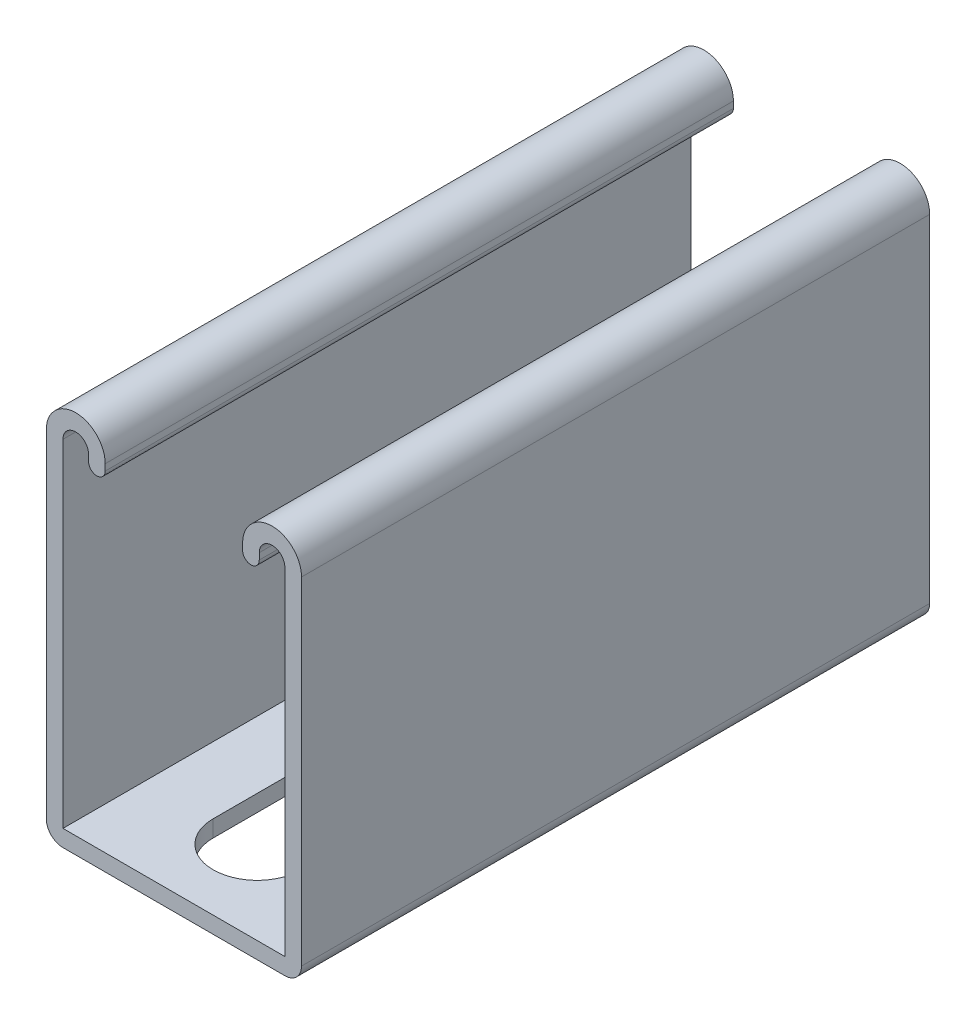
ISO-10303-21;
HEADER;
FILE_DESCRIPTION(('STEP AP214'),'2;1');
FILE_NAME('part.step','',(''),(''),'','','');
FILE_SCHEMA(('AUTOMOTIVE_DESIGN { 1 0 10303 214 1 1 1 1 }'));
ENDSEC;
DATA;
#1=APPLICATION_CONTEXT('core data for automotive mechanical design processes');
#2=APPLICATION_PROTOCOL_DEFINITION('international standard','automotive_design',2000,#1);
#3=PRODUCT_CONTEXT('',#1,'mechanical');
#4=PRODUCT('Part','Part','',(#3));
#5=PRODUCT_RELATED_PRODUCT_CATEGORY('part','',(#4));
#6=PRODUCT_DEFINITION_FORMATION('','',#4);
#7=PRODUCT_DEFINITION_CONTEXT('part definition',#1,'design');
#8=PRODUCT_DEFINITION('design','',#6,#7);
#9=PRODUCT_DEFINITION_SHAPE('','',#8);
#10=(LENGTH_UNIT() NAMED_UNIT(*) SI_UNIT(.MILLI.,.METRE.));
#11=(NAMED_UNIT(*) PLANE_ANGLE_UNIT() SI_UNIT($,.RADIAN.));
#12=(NAMED_UNIT(*) SI_UNIT($,.STERADIAN.) SOLID_ANGLE_UNIT());
#13=UNCERTAINTY_MEASURE_WITH_UNIT(LENGTH_MEASURE(1.E-05),#10,'distance_accuracy_value','');
#14=(GEOMETRIC_REPRESENTATION_CONTEXT(3) GLOBAL_UNCERTAINTY_ASSIGNED_CONTEXT((#13)) GLOBAL_UNIT_ASSIGNED_CONTEXT((#10,
#11,#12)) REPRESENTATION_CONTEXT('',''));
#15=CARTESIAN_POINT('',(0.,0.,0.));
#16=DIRECTION('',(0.,0.,1.));
#17=DIRECTION('',(1.,0.,0.));
#18=AXIS2_PLACEMENT_3D('',#15,#16,#17);
#19=CARTESIAN_POINT('',(-15.875,29.1719,101.6));
#20=DIRECTION('',(0.,0.,-1.));
#21=DIRECTION('',(-1.,0.,0.));
#22=AXIS2_PLACEMENT_3D('',#19,#20,#21);
#23=CYLINDRICAL_SURFACE('',#22,4.7625);
#24=CARTESIAN_POINT('',(-15.875,29.1719,0.));
#25=DIRECTION('',(0.,0.,1.));
#26=DIRECTION('',(-1.,0.,0.));
#27=AXIS2_PLACEMENT_3D('',#24,#25,#26);
#28=CIRCLE('',#27,4.7625);
#29=CARTESIAN_POINT('',(-11.1125,29.1719,0.));
#30=VERTEX_POINT('',#29);
#31=CARTESIAN_POINT('',(-20.6375,29.1719,0.));
#32=VERTEX_POINT('',#31);
#33=EDGE_CURVE('E254',#30,#32,#28,.T.);
#34=ORIENTED_EDGE('',*,*,#33,.T.);
#35=DIRECTION('',(0.,0.,-1.));
#36=VECTOR('',#35,1.);
#37=CARTESIAN_POINT('',(-20.6375,29.1719,101.6));
#38=LINE('',#37,#36);
#39=CARTESIAN_POINT('',(-20.6375,29.1719,101.6));
#40=VERTEX_POINT('',#39);
#41=EDGE_CURVE('E385',#40,#32,#38,.T.);
#42=ORIENTED_EDGE('',*,*,#41,.F.);
#43=CARTESIAN_POINT('',(-15.875,29.1719,101.6));
#44=DIRECTION('',(0.,0.,1.));
#45=DIRECTION('',(-1.,0.,0.));
#46=AXIS2_PLACEMENT_3D('',#43,#44,#45);
#47=CIRCLE('',#46,4.7625);
#48=CARTESIAN_POINT('',(-11.1125,29.1719,101.6));
#49=VERTEX_POINT('',#48);
#50=EDGE_CURVE('E261',#49,#40,#47,.T.);
#51=ORIENTED_EDGE('',*,*,#50,.F.);
#52=DIRECTION('',(0.,0.,-1.));
#53=VECTOR('',#52,1.);
#54=CARTESIAN_POINT('',(-11.1125,29.1719,101.6));
#55=LINE('',#54,#53);
#56=EDGE_CURVE('E299',#49,#30,#55,.T.);
#57=ORIENTED_EDGE('',*,*,#56,.T.);
#58=EDGE_LOOP('',(#34,#42,#51,#57));
#59=FACE_BOUND('',#58,.T.);
#60=ADVANCED_FACE('F33',(#59),#23,.T.);
#61=CARTESIAN_POINT('',(-20.6375,29.1719,101.6));
#62=DIRECTION('',(1.,0.,0.));
#63=DIRECTION('',(0.,1.,0.));
#64=AXIS2_PLACEMENT_3D('',#61,#62,#63);
#65=PLANE('',#64);
#66=DIRECTION('',(0.,-1.,0.));
#67=VECTOR('',#66,1.);
#68=CARTESIAN_POINT('',(-20.6375,29.1719,0.));
#69=LINE('',#68,#67);
#70=CARTESIAN_POINT('',(-20.6375,-25.3238,0.));
#71=VERTEX_POINT('',#70);
#72=EDGE_CURVE('E302',#32,#71,#69,.T.);
#73=ORIENTED_EDGE('',*,*,#72,.T.);
#74=DIRECTION('',(0.,0.,-1.));
#75=VECTOR('',#74,1.);
#76=CARTESIAN_POINT('',(-20.6375,-25.3238,101.6));
#77=LINE('',#76,#75);
#78=CARTESIAN_POINT('',(-20.6375,-25.3238,101.6));
#79=VERTEX_POINT('',#78);
#80=EDGE_CURVE('E382',#79,#71,#77,.T.);
#81=ORIENTED_EDGE('',*,*,#80,.F.);
#82=DIRECTION('',(0.,-1.,0.));
#83=VECTOR('',#82,1.);
#84=CARTESIAN_POINT('',(-20.6375,29.1719,101.6));
#85=LINE('',#84,#83);
#86=EDGE_CURVE('E264',#40,#79,#85,.T.);
#87=ORIENTED_EDGE('',*,*,#86,.F.);
#88=ORIENTED_EDGE('',*,*,#41,.T.);
#89=EDGE_LOOP('',(#73,#81,#87,#88));
#90=FACE_BOUND('',#89,.T.);
#91=ADVANCED_FACE('F426',(#90),#65,.F.);
#92=CARTESIAN_POINT('',(-17.9451,-25.3238,101.6));
#93=DIRECTION('',(0.,0.,-1.));
#94=DIRECTION('',(-1.,0.,0.));
#95=AXIS2_PLACEMENT_3D('',#92,#93,#94);
#96=CYLINDRICAL_SURFACE('',#95,2.6924);
#97=CARTESIAN_POINT('',(-17.9451,-25.3238,0.));
#98=DIRECTION('',(0.,0.,1.));
#99=DIRECTION('',(-1.,0.,0.));
#100=AXIS2_PLACEMENT_3D('',#97,#98,#99);
#101=CIRCLE('',#100,2.6924);
#102=CARTESIAN_POINT('',(-17.9451,-28.0162,0.));
#103=VERTEX_POINT('',#102);
#104=EDGE_CURVE('E304',#71,#103,#101,.T.);
#105=ORIENTED_EDGE('',*,*,#104,.T.);
#106=DIRECTION('',(0.,0.,-1.));
#107=VECTOR('',#106,1.);
#108=CARTESIAN_POINT('',(-17.9451,-28.0162,101.6));
#109=LINE('',#108,#107);
#110=CARTESIAN_POINT('',(-17.9451,-28.0162,101.6));
#111=VERTEX_POINT('',#110);
#112=EDGE_CURVE('E379',#111,#103,#109,.T.);
#113=ORIENTED_EDGE('',*,*,#112,.F.);
#114=CARTESIAN_POINT('',(-17.9451,-25.3238,101.6));
#115=DIRECTION('',(0.,0.,1.));
#116=DIRECTION('',(-1.,0.,0.));
#117=AXIS2_PLACEMENT_3D('',#114,#115,#116);
#118=CIRCLE('',#117,2.6924);
#119=EDGE_CURVE('E267',#79,#111,#118,.T.);
#120=ORIENTED_EDGE('',*,*,#119,.F.);
#121=ORIENTED_EDGE('',*,*,#80,.T.);
#122=EDGE_LOOP('',(#105,#113,#120,#121));
#123=FACE_BOUND('',#122,.T.);
#124=ADVANCED_FACE('F431',(#123),#96,.T.);
#125=CARTESIAN_POINT('',(-17.9451,-28.0162,101.6));
#126=DIRECTION('',(0.,1.,0.));
#127=DIRECTION('',(-1.,0.,0.));
#128=AXIS2_PLACEMENT_3D('',#125,#126,#127);
#129=PLANE('',#128);
#130=DIRECTION('',(0.,0.,-1.));
#131=VECTOR('',#130,1.);
#132=CARTESIAN_POINT('',(-7.14375,-28.0162000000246,73.81875));
#133=LINE('',#132,#131);
#134=CARTESIAN_POINT('',(-7.14375,-28.0162,88.10625));
#135=VERTEX_POINT('',#134);
#136=CARTESIAN_POINT('',(-7.14375,-28.0162000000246,73.81875));
#137=VERTEX_POINT('',#136);
#138=EDGE_CURVE('E207',#135,#137,#133,.T.);
#139=ORIENTED_EDGE('',*,*,#138,.F.);
#140=CARTESIAN_POINT('',(0.,-28.0162000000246,88.10625));
#141=DIRECTION('',(0.,-1.,0.));
#142=DIRECTION('',(1.,0.,0.));
#143=AXIS2_PLACEMENT_3D('',#140,#141,#142);
#144=CIRCLE('',#143,7.14375);
#145=CARTESIAN_POINT('',(7.14375,-28.0162000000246,88.10625));
#146=VERTEX_POINT('',#145);
#147=EDGE_CURVE('E47',#146,#135,#144,.T.);
#148=ORIENTED_EDGE('',*,*,#147,.F.);
#149=DIRECTION('',(0.,0.,1.));
#150=VECTOR('',#149,1.);
#151=CARTESIAN_POINT('',(7.14375,-28.0162000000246,88.10625));
#152=LINE('',#151,#150);
#153=CARTESIAN_POINT('',(7.14375000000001,-28.0162000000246,73.81875));
#154=VERTEX_POINT('',#153);
#155=EDGE_CURVE('E223',#154,#146,#152,.T.);
#156=ORIENTED_EDGE('',*,*,#155,.F.);
#157=CARTESIAN_POINT('',(0.,-28.0162000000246,73.81875));
#158=DIRECTION('',(0.,-1.,0.));
#159=DIRECTION('',(1.,0.,0.));
#160=AXIS2_PLACEMENT_3D('',#157,#158,#159);
#161=CIRCLE('',#160,7.14375);
#162=EDGE_CURVE('E217',#137,#154,#161,.T.);
#163=ORIENTED_EDGE('',*,*,#162,.F.);
#164=EDGE_LOOP('',(#139,#148,#156,#163));
#165=FACE_BOUND('',#164,.T.);
#166=DIRECTION('',(0.,0.,-1.));
#167=VECTOR('',#166,1.);
#168=CARTESIAN_POINT('',(-7.14375,-28.0162000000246,23.01875));
#169=LINE('',#168,#167);
#170=CARTESIAN_POINT('',(-7.14375,-28.0162,37.30625));
#171=VERTEX_POINT('',#170);
#172=CARTESIAN_POINT('',(-7.14375,-28.0162000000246,23.01875));
#173=VERTEX_POINT('',#172);
#174=EDGE_CURVE('E242',#171,#173,#169,.T.);
#175=ORIENTED_EDGE('',*,*,#174,.F.);
#176=CARTESIAN_POINT('',(0.,-28.0162000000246,37.30625));
#177=DIRECTION('',(0.,-1.,0.));
#178=DIRECTION('',(1.,0.,0.));
#179=AXIS2_PLACEMENT_3D('',#176,#177,#178);
#180=CIRCLE('',#179,7.14375);
#181=CARTESIAN_POINT('',(7.14375,-28.0162000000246,37.30625));
#182=VERTEX_POINT('',#181);
#183=EDGE_CURVE('E240',#182,#171,#180,.T.);
#184=ORIENTED_EDGE('',*,*,#183,.F.);
#185=DIRECTION('',(0.,0.,1.));
#186=VECTOR('',#185,1.);
#187=CARTESIAN_POINT('',(7.14375,-28.0162000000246,37.30625));
#188=LINE('',#187,#186);
#189=CARTESIAN_POINT('',(7.14375000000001,-28.0162000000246,23.01875));
#190=VERTEX_POINT('',#189);
#191=EDGE_CURVE('E248',#190,#182,#188,.T.);
#192=ORIENTED_EDGE('',*,*,#191,.F.);
#193=CARTESIAN_POINT('',(0.,-28.0162000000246,23.01875));
#194=DIRECTION('',(0.,-1.,0.));
#195=DIRECTION('',(1.,0.,0.));
#196=AXIS2_PLACEMENT_3D('',#193,#194,#195);
#197=CIRCLE('',#196,7.14375);
#198=EDGE_CURVE('E245',#173,#190,#197,.T.);
#199=ORIENTED_EDGE('',*,*,#198,.F.);
#200=EDGE_LOOP('',(#175,#184,#192,#199));
#201=FACE_BOUND('',#200,.T.);
#202=DIRECTION('',(1.,0.,0.));
#203=VECTOR('',#202,1.);
#204=CARTESIAN_POINT('',(-17.9451,-28.0162,0.));
#205=LINE('',#204,#203);
#206=CARTESIAN_POINT('',(17.9451,-28.0162,0.));
#207=VERTEX_POINT('',#206);
#208=EDGE_CURVE('E306',#103,#207,#205,.T.);
#209=ORIENTED_EDGE('',*,*,#208,.T.);
#210=DIRECTION('',(0.,0.,-1.));
#211=VECTOR('',#210,1.);
#212=CARTESIAN_POINT('',(17.9451,-28.0162,101.6));
#213=LINE('',#212,#211);
#214=CARTESIAN_POINT('',(17.9451,-28.0162,101.6));
#215=VERTEX_POINT('',#214);
#216=EDGE_CURVE('E376',#215,#207,#213,.T.);
#217=ORIENTED_EDGE('',*,*,#216,.F.);
#218=DIRECTION('',(1.,0.,0.));
#219=VECTOR('',#218,1.);
#220=CARTESIAN_POINT('',(-17.9451,-28.0162,101.6));
#221=LINE('',#220,#219);
#222=EDGE_CURVE('E269',#111,#215,#221,.T.);
#223=ORIENTED_EDGE('',*,*,#222,.F.);
#224=ORIENTED_EDGE('',*,*,#112,.T.);
#225=EDGE_LOOP('',(#209,#217,#223,#224));
#226=FACE_BOUND('',#225,.T.);
#227=ADVANCED_FACE('F221',(#165,#201,#226),#129,.F.);
#228=CARTESIAN_POINT('',(17.9451,-25.3238,101.6));
#229=DIRECTION('',(0.,0.,-1.));
#230=DIRECTION('',(-1.,0.,0.));
#231=AXIS2_PLACEMENT_3D('',#228,#229,#230);
#232=CYLINDRICAL_SURFACE('',#231,2.6924);
#233=CARTESIAN_POINT('',(17.9451,-25.3238,0.));
#234=DIRECTION('',(0.,0.,1.));
#235=DIRECTION('',(1.,0.,0.));
#236=AXIS2_PLACEMENT_3D('',#233,#234,#235);
#237=CIRCLE('',#236,2.6924);
#238=CARTESIAN_POINT('',(20.6375,-25.3238,0.));
#239=VERTEX_POINT('',#238);
#240=EDGE_CURVE('E308',#207,#239,#237,.T.);
#241=ORIENTED_EDGE('',*,*,#240,.T.);
#242=DIRECTION('',(0.,0.,-1.));
#243=VECTOR('',#242,1.);
#244=CARTESIAN_POINT('',(20.6375,-25.3238,101.6));
#245=LINE('',#244,#243);
#246=CARTESIAN_POINT('',(20.6375,-25.3238,101.6));
#247=VERTEX_POINT('',#246);
#248=EDGE_CURVE('E373',#247,#239,#245,.T.);
#249=ORIENTED_EDGE('',*,*,#248,.F.);
#250=CARTESIAN_POINT('',(17.9451,-25.3238,101.6));
#251=DIRECTION('',(0.,0.,1.));
#252=DIRECTION('',(1.,0.,0.));
#253=AXIS2_PLACEMENT_3D('',#250,#251,#252);
#254=CIRCLE('',#253,2.6924);
#255=EDGE_CURVE('E271',#215,#247,#254,.T.);
#256=ORIENTED_EDGE('',*,*,#255,.F.);
#257=ORIENTED_EDGE('',*,*,#216,.T.);
#258=EDGE_LOOP('',(#241,#249,#256,#257));
#259=FACE_BOUND('',#258,.T.);
#260=ADVANCED_FACE('F511',(#259),#232,.T.);
#261=CARTESIAN_POINT('',(20.6375,-25.3238,101.6));
#262=DIRECTION('',(-1.,0.,0.));
#263=DIRECTION('',(0.,-1.,0.));
#264=AXIS2_PLACEMENT_3D('',#261,#262,#263);
#265=PLANE('',#264);
#266=DIRECTION('',(0.,1.,0.));
#267=VECTOR('',#266,1.);
#268=CARTESIAN_POINT('',(20.6375,-25.3238,0.));
#269=LINE('',#268,#267);
#270=CARTESIAN_POINT('',(20.6375,29.1719,0.));
#271=VERTEX_POINT('',#270);
#272=EDGE_CURVE('E310',#239,#271,#269,.T.);
#273=ORIENTED_EDGE('',*,*,#272,.T.);
#274=DIRECTION('',(0.,0.,-1.));
#275=VECTOR('',#274,1.);
#276=CARTESIAN_POINT('',(20.6375,29.1719,101.6));
#277=LINE('',#276,#275);
#278=CARTESIAN_POINT('',(20.6375,29.1719,101.6));
#279=VERTEX_POINT('',#278);
#280=EDGE_CURVE('E370',#279,#271,#277,.T.);
#281=ORIENTED_EDGE('',*,*,#280,.F.);
#282=DIRECTION('',(0.,1.,0.));
#283=VECTOR('',#282,1.);
#284=CARTESIAN_POINT('',(20.6375,-25.3238,101.6));
#285=LINE('',#284,#283);
#286=EDGE_CURVE('E273',#247,#279,#285,.T.);
#287=ORIENTED_EDGE('',*,*,#286,.F.);
#288=ORIENTED_EDGE('',*,*,#248,.T.);
#289=EDGE_LOOP('',(#273,#281,#287,#288));
#290=FACE_BOUND('',#289,.T.);
#291=ADVANCED_FACE('F507',(#290),#265,.F.);
#292=CARTESIAN_POINT('',(15.875,29.1719,101.6));
#293=DIRECTION('',(0.,0.,-1.));
#294=DIRECTION('',(-1.,0.,0.));
#295=AXIS2_PLACEMENT_3D('',#292,#293,#294);
#296=CYLINDRICAL_SURFACE('',#295,4.7625);
#297=CARTESIAN_POINT('',(15.875,29.1719,0.));
#298=DIRECTION('',(0.,0.,1.));
#299=DIRECTION('',(1.,0.,0.));
#300=AXIS2_PLACEMENT_3D('',#297,#298,#299);
#301=CIRCLE('',#300,4.7625);
#302=CARTESIAN_POINT('',(11.1125,29.1719,0.));
#303=VERTEX_POINT('',#302);
#304=EDGE_CURVE('E312',#271,#303,#301,.T.);
#305=ORIENTED_EDGE('',*,*,#304,.T.);
#306=DIRECTION('',(0.,0.,-1.));
#307=VECTOR('',#306,1.);
#308=CARTESIAN_POINT('',(11.1125,29.1719,101.6));
#309=LINE('',#308,#307);
#310=CARTESIAN_POINT('',(11.1125,29.1719,101.6));
#311=VERTEX_POINT('',#310);
#312=EDGE_CURVE('E367',#311,#303,#309,.T.);
#313=ORIENTED_EDGE('',*,*,#312,.F.);
#314=CARTESIAN_POINT('',(15.875,29.1719,101.6));
#315=DIRECTION('',(0.,0.,1.));
#316=DIRECTION('',(1.,0.,0.));
#317=AXIS2_PLACEMENT_3D('',#314,#315,#316);
#318=CIRCLE('',#317,4.7625);
#319=EDGE_CURVE('E275',#279,#311,#318,.T.);
#320=ORIENTED_EDGE('',*,*,#319,.F.);
#321=ORIENTED_EDGE('',*,*,#280,.T.);
#322=EDGE_LOOP('',(#305,#313,#320,#321));
#323=FACE_BOUND('',#322,.T.);
#324=ADVANCED_FACE('F502',(#323),#296,.T.);
#325=CARTESIAN_POINT('',(11.1125,29.1719,101.6));
#326=DIRECTION('',(1.,0.,0.));
#327=DIRECTION('',(0.,1.,0.));
#328=AXIS2_PLACEMENT_3D('',#325,#326,#327);
#329=PLANE('',#328);
#330=DIRECTION('',(0.,-1.,0.));
#331=VECTOR('',#330,1.);
#332=CARTESIAN_POINT('',(11.1125,29.1719,0.));
#333=LINE('',#332,#331);
#334=CARTESIAN_POINT('',(11.1125,28.13685,0.));
#335=VERTEX_POINT('',#334);
#336=EDGE_CURVE('E314',#303,#335,#333,.T.);
#337=ORIENTED_EDGE('',*,*,#336,.T.);
#338=DIRECTION('',(0.,0.,-1.));
#339=VECTOR('',#338,1.);
#340=CARTESIAN_POINT('',(11.1125,28.13685,101.6));
#341=LINE('',#340,#339);
#342=CARTESIAN_POINT('',(11.1125,28.13685,101.6));
#343=VERTEX_POINT('',#342);
#344=EDGE_CURVE('E364',#343,#335,#341,.T.);
#345=ORIENTED_EDGE('',*,*,#344,.F.);
#346=DIRECTION('',(0.,-1.,0.));
#347=VECTOR('',#346,1.);
#348=CARTESIAN_POINT('',(11.1125,29.1719,101.6));
#349=LINE('',#348,#347);
#350=EDGE_CURVE('E277',#311,#343,#349,.T.);
#351=ORIENTED_EDGE('',*,*,#350,.F.);
#352=ORIENTED_EDGE('',*,*,#312,.T.);
#353=EDGE_LOOP('',(#337,#345,#351,#352));
#354=FACE_BOUND('',#353,.T.);
#355=ADVANCED_FACE('F496',(#354),#329,.F.);
#356=CARTESIAN_POINT('',(12.4587,28.13685,101.6));
#357=DIRECTION('',(0.,0.,-1.));
#358=DIRECTION('',(-1.,0.,0.));
#359=AXIS2_PLACEMENT_3D('',#356,#357,#358);
#360=CYLINDRICAL_SURFACE('',#359,1.3462);
#361=CARTESIAN_POINT('',(12.4587,28.13685,0.));
#362=DIRECTION('',(0.,0.,1.));
#363=DIRECTION('',(1.,0.,0.));
#364=AXIS2_PLACEMENT_3D('',#361,#362,#363);
#365=CIRCLE('',#364,1.3462);
#366=CARTESIAN_POINT('',(13.8049,28.13685,0.));
#367=VERTEX_POINT('',#366);
#368=EDGE_CURVE('E316',#335,#367,#365,.T.);
#369=ORIENTED_EDGE('',*,*,#368,.T.);
#370=DIRECTION('',(0.,0.,-1.));
#371=VECTOR('',#370,1.);
#372=CARTESIAN_POINT('',(13.8049,28.13685,101.6));
#373=LINE('',#372,#371);
#374=CARTESIAN_POINT('',(13.8049,28.13685,101.6));
#375=VERTEX_POINT('',#374);
#376=EDGE_CURVE('E361',#375,#367,#373,.T.);
#377=ORIENTED_EDGE('',*,*,#376,.F.);
#378=CARTESIAN_POINT('',(12.4587,28.13685,101.6));
#379=DIRECTION('',(0.,0.,1.));
#380=DIRECTION('',(1.,0.,0.));
#381=AXIS2_PLACEMENT_3D('',#378,#379,#380);
#382=CIRCLE('',#381,1.3462);
#383=EDGE_CURVE('E279',#343,#375,#382,.T.);
#384=ORIENTED_EDGE('',*,*,#383,.F.);
#385=ORIENTED_EDGE('',*,*,#344,.T.);
#386=EDGE_LOOP('',(#369,#377,#384,#385));
#387=FACE_BOUND('',#386,.T.);
#388=ADVANCED_FACE('F492',(#387),#360,.T.);
#389=CARTESIAN_POINT('',(13.8049,29.1719,101.6));
#390=DIRECTION('',(-1.,0.,0.));
#391=DIRECTION('',(0.,0.,1.));
#392=AXIS2_PLACEMENT_3D('',#389,#390,#391);
#393=PLANE('',#392);
#394=DIRECTION('',(0.,1.,0.));
#395=VECTOR('',#394,1.);
#396=CARTESIAN_POINT('',(13.8049,29.1719,0.));
#397=LINE('',#396,#395);
#398=CARTESIAN_POINT('',(13.8049,29.1719,0.));
#399=VERTEX_POINT('',#398);
#400=EDGE_CURVE('E318',#367,#399,#397,.T.);
#401=ORIENTED_EDGE('',*,*,#400,.T.);
#402=DIRECTION('',(0.,0.,-1.));
#403=VECTOR('',#402,1.);
#404=CARTESIAN_POINT('',(13.8049,29.1719,101.6));
#405=LINE('',#404,#403);
#406=CARTESIAN_POINT('',(13.8049,29.1719,101.6));
#407=VERTEX_POINT('',#406);
#408=EDGE_CURVE('E358',#407,#399,#405,.T.);
#409=ORIENTED_EDGE('',*,*,#408,.F.);
#410=DIRECTION('',(0.,1.,0.));
#411=VECTOR('',#410,1.);
#412=CARTESIAN_POINT('',(13.8049,29.1719,101.6));
#413=LINE('',#412,#411);
#414=EDGE_CURVE('E281',#375,#407,#413,.T.);
#415=ORIENTED_EDGE('',*,*,#414,.F.);
#416=ORIENTED_EDGE('',*,*,#376,.T.);
#417=EDGE_LOOP('',(#401,#409,#415,#416));
#418=FACE_BOUND('',#417,.T.);
#419=ADVANCED_FACE('F487',(#418),#393,.F.);
#420=CARTESIAN_POINT('',(15.875,29.1719,101.6));
#421=DIRECTION('',(0.,0.,-1.));
#422=DIRECTION('',(-1.,0.,0.));
#423=AXIS2_PLACEMENT_3D('',#420,#421,#422);
#424=CYLINDRICAL_SURFACE('',#423,2.0701);
#425=CARTESIAN_POINT('',(15.875,29.1719,0.));
#426=DIRECTION('',(0.,0.,-1.));
#427=DIRECTION('',(1.,0.,0.));
#428=AXIS2_PLACEMENT_3D('',#425,#426,#427);
#429=CIRCLE('',#428,2.0701);
#430=CARTESIAN_POINT('',(17.9451,29.1719,0.));
#431=VERTEX_POINT('',#430);
#432=EDGE_CURVE('E320',#399,#431,#429,.T.);
#433=ORIENTED_EDGE('',*,*,#432,.T.);
#434=DIRECTION('',(0.,0.,-1.));
#435=VECTOR('',#434,1.);
#436=CARTESIAN_POINT('',(17.9451,29.1719,101.6));
#437=LINE('',#436,#435);
#438=CARTESIAN_POINT('',(17.9451,29.1719,101.6));
#439=VERTEX_POINT('',#438);
#440=EDGE_CURVE('E355',#439,#431,#437,.T.);
#441=ORIENTED_EDGE('',*,*,#440,.F.);
#442=CARTESIAN_POINT('',(15.875,29.1719,101.6));
#443=DIRECTION('',(0.,0.,-1.));
#444=DIRECTION('',(1.,0.,0.));
#445=AXIS2_PLACEMENT_3D('',#442,#443,#444);
#446=CIRCLE('',#445,2.0701);
#447=EDGE_CURVE('E283',#407,#439,#446,.T.);
#448=ORIENTED_EDGE('',*,*,#447,.F.);
#449=ORIENTED_EDGE('',*,*,#408,.T.);
#450=EDGE_LOOP('',(#433,#441,#448,#449));
#451=FACE_BOUND('',#450,.T.);
#452=ADVANCED_FACE('F481',(#451),#424,.F.);
#453=CARTESIAN_POINT('',(17.9451,-25.3238,101.6));
#454=DIRECTION('',(1.,0.,0.));
#455=DIRECTION('',(0.,0.,-1.));
#456=AXIS2_PLACEMENT_3D('',#453,#454,#455);
#457=PLANE('',#456);
#458=DIRECTION('',(0.,-1.,0.));
#459=VECTOR('',#458,1.);
#460=CARTESIAN_POINT('',(17.9451,-25.3238,0.));
#461=LINE('',#460,#459);
#462=CARTESIAN_POINT('',(17.9451,-25.3238,0.));
#463=VERTEX_POINT('',#462);
#464=EDGE_CURVE('E322',#431,#463,#461,.T.);
#465=ORIENTED_EDGE('',*,*,#464,.T.);
#466=DIRECTION('',(0.,0.,-1.));
#467=VECTOR('',#466,1.);
#468=CARTESIAN_POINT('',(17.9451,-25.3238,101.6));
#469=LINE('',#468,#467);
#470=CARTESIAN_POINT('',(17.9451,-25.3238,101.6));
#471=VERTEX_POINT('',#470);
#472=EDGE_CURVE('E352',#471,#463,#469,.T.);
#473=ORIENTED_EDGE('',*,*,#472,.F.);
#474=DIRECTION('',(0.,-1.,0.));
#475=VECTOR('',#474,1.);
#476=CARTESIAN_POINT('',(17.9451,-25.3238,101.6));
#477=LINE('',#476,#475);
#478=EDGE_CURVE('E285',#439,#471,#477,.T.);
#479=ORIENTED_EDGE('',*,*,#478,.F.);
#480=ORIENTED_EDGE('',*,*,#440,.T.);
#481=EDGE_LOOP('',(#465,#473,#479,#480));
#482=FACE_BOUND('',#481,.T.);
#483=ADVANCED_FACE('F477',(#482),#457,.F.);
#484=CARTESIAN_POINT('',(-17.9451,-25.3238,101.6));
#485=DIRECTION('',(0.,-1.,0.));
#486=DIRECTION('',(0.,0.,-1.));
#487=AXIS2_PLACEMENT_3D('',#484,#485,#486);
#488=PLANE('',#487);
#489=DIRECTION('',(0.,0.,1.));
#490=VECTOR('',#489,1.);
#491=CARTESIAN_POINT('',(7.14374999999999,-25.3238,152.4));
#492=LINE('',#491,#490);
#493=CARTESIAN_POINT('',(7.14375000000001,-25.3238,73.81875));
#494=VERTEX_POINT('',#493);
#495=CARTESIAN_POINT('',(7.14375,-25.3238,88.10625));
#496=VERTEX_POINT('',#495);
#497=EDGE_CURVE('E233',#494,#496,#492,.T.);
#498=ORIENTED_EDGE('',*,*,#497,.T.);
#499=CARTESIAN_POINT('',(0.,-25.3238,88.10625));
#500=DIRECTION('',(0.,-1.,0.));
#501=DIRECTION('',(0.,0.,-1.));
#502=AXIS2_PLACEMENT_3D('',#499,#500,#501);
#503=CIRCLE('',#502,7.14375);
#504=CARTESIAN_POINT('',(-7.14375,-25.3238,88.10625));
#505=VERTEX_POINT('',#504);
#506=EDGE_CURVE('E237',#496,#505,#503,.T.);
#507=ORIENTED_EDGE('',*,*,#506,.T.);
#508=DIRECTION('',(0.,0.,-1.));
#509=VECTOR('',#508,1.);
#510=CARTESIAN_POINT('',(-7.14375,-25.3238,152.4));
#511=LINE('',#510,#509);
#512=CARTESIAN_POINT('',(-7.14375,-25.3238,73.81875));
#513=VERTEX_POINT('',#512);
#514=EDGE_CURVE('E214',#505,#513,#511,.T.);
#515=ORIENTED_EDGE('',*,*,#514,.T.);
#516=CARTESIAN_POINT('',(0.,-25.3238,73.81875));
#517=DIRECTION('',(0.,-1.,0.));
#518=DIRECTION('',(0.,0.,-1.));
#519=AXIS2_PLACEMENT_3D('',#516,#517,#518);
#520=CIRCLE('',#519,7.14375);
#521=EDGE_CURVE('E55',#513,#494,#520,.T.);
#522=ORIENTED_EDGE('',*,*,#521,.T.);
#523=EDGE_LOOP('',(#498,#507,#515,#522));
#524=FACE_BOUND('',#523,.T.);
#525=DIRECTION('',(0.,0.,1.));
#526=VECTOR('',#525,1.);
#527=CARTESIAN_POINT('',(7.14374999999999,-25.3238,101.6));
#528=LINE('',#527,#526);
#529=CARTESIAN_POINT('',(7.14375000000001,-25.3238,23.01875));
#530=VERTEX_POINT('',#529);
#531=CARTESIAN_POINT('',(7.14375,-25.3238,37.30625));
#532=VERTEX_POINT('',#531);
#533=EDGE_CURVE('E40',#530,#532,#528,.T.);
#534=ORIENTED_EDGE('',*,*,#533,.T.);
#535=CARTESIAN_POINT('',(0.,-25.3238,37.30625));
#536=DIRECTION('',(0.,-1.,0.));
#537=DIRECTION('',(0.,0.,-1.));
#538=AXIS2_PLACEMENT_3D('',#535,#536,#537);
#539=CIRCLE('',#538,7.14375);
#540=CARTESIAN_POINT('',(-7.14375,-25.3238,37.30625));
#541=VERTEX_POINT('',#540);
#542=EDGE_CURVE('E11',#532,#541,#539,.T.);
#543=ORIENTED_EDGE('',*,*,#542,.T.);
#544=DIRECTION('',(0.,0.,-1.));
#545=VECTOR('',#544,1.);
#546=CARTESIAN_POINT('',(-7.14375,-25.3238,101.6));
#547=LINE('',#546,#545);
#548=CARTESIAN_POINT('',(-7.14375,-25.3238,23.01875));
#549=VERTEX_POINT('',#548);
#550=EDGE_CURVE('E388',#541,#549,#547,.T.);
#551=ORIENTED_EDGE('',*,*,#550,.T.);
#552=CARTESIAN_POINT('',(0.,-25.3238,23.01875));
#553=DIRECTION('',(0.,-1.,0.));
#554=DIRECTION('',(0.,0.,-1.));
#555=AXIS2_PLACEMENT_3D('',#552,#553,#554);
#556=CIRCLE('',#555,7.14375);
#557=EDGE_CURVE('E391',#549,#530,#556,.T.);
#558=ORIENTED_EDGE('',*,*,#557,.T.);
#559=EDGE_LOOP('',(#534,#543,#551,#558));
#560=FACE_BOUND('',#559,.T.);
#561=DIRECTION('',(-1.,0.,0.));
#562=VECTOR('',#561,1.);
#563=CARTESIAN_POINT('',(-17.9451,-25.3238,0.));
#564=LINE('',#563,#562);
#565=CARTESIAN_POINT('',(-17.9451,-25.3238,0.));
#566=VERTEX_POINT('',#565);
#567=EDGE_CURVE('E324',#463,#566,#564,.T.);
#568=ORIENTED_EDGE('',*,*,#567,.T.);
#569=DIRECTION('',(0.,0.,-1.));
#570=VECTOR('',#569,1.);
#571=CARTESIAN_POINT('',(-17.9451,-25.3238,101.6));
#572=LINE('',#571,#570);
#573=CARTESIAN_POINT('',(-17.9451,-25.3238,101.6));
#574=VERTEX_POINT('',#573);
#575=EDGE_CURVE('E349',#574,#566,#572,.T.);
#576=ORIENTED_EDGE('',*,*,#575,.F.);
#577=DIRECTION('',(-1.,0.,0.));
#578=VECTOR('',#577,1.);
#579=CARTESIAN_POINT('',(-17.9451,-25.3238,101.6));
#580=LINE('',#579,#578);
#581=EDGE_CURVE('E287',#471,#574,#580,.T.);
#582=ORIENTED_EDGE('',*,*,#581,.F.);
#583=ORIENTED_EDGE('',*,*,#472,.T.);
#584=EDGE_LOOP('',(#568,#576,#582,#583));
#585=FACE_BOUND('',#584,.T.);
#586=ADVANCED_FACE('F395',(#524,#560,#585),#488,.F.);
#587=CARTESIAN_POINT('',(-17.9451,29.1719,101.6));
#588=DIRECTION('',(-1.,0.,0.));
#589=DIRECTION('',(0.,-1.,0.));
#590=AXIS2_PLACEMENT_3D('',#587,#588,#589);
#591=PLANE('',#590);
#592=DIRECTION('',(0.,1.,0.));
#593=VECTOR('',#592,1.);
#594=CARTESIAN_POINT('',(-17.9451,29.1719,0.));
#595=LINE('',#594,#593);
#596=CARTESIAN_POINT('',(-17.9451,29.1719,0.));
#597=VERTEX_POINT('',#596);
#598=EDGE_CURVE('E326',#566,#597,#595,.T.);
#599=ORIENTED_EDGE('',*,*,#598,.T.);
#600=DIRECTION('',(0.,0.,-1.));
#601=VECTOR('',#600,1.);
#602=CARTESIAN_POINT('',(-17.9451,29.1719,101.6));
#603=LINE('',#602,#601);
#604=CARTESIAN_POINT('',(-17.9451,29.1719,101.6));
#605=VERTEX_POINT('',#604);
#606=EDGE_CURVE('E346',#605,#597,#603,.T.);
#607=ORIENTED_EDGE('',*,*,#606,.F.);
#608=DIRECTION('',(0.,1.,0.));
#609=VECTOR('',#608,1.);
#610=CARTESIAN_POINT('',(-17.9451,29.1719,101.6));
#611=LINE('',#610,#609);
#612=EDGE_CURVE('E289',#574,#605,#611,.T.);
#613=ORIENTED_EDGE('',*,*,#612,.F.);
#614=ORIENTED_EDGE('',*,*,#575,.T.);
#615=EDGE_LOOP('',(#599,#607,#613,#614));
#616=FACE_BOUND('',#615,.T.);
#617=ADVANCED_FACE('F468',(#616),#591,.F.);
#618=CARTESIAN_POINT('',(-15.875,29.1719,101.6));
#619=DIRECTION('',(0.,0.,-1.));
#620=DIRECTION('',(-1.,0.,0.));
#621=AXIS2_PLACEMENT_3D('',#618,#619,#620);
#622=CYLINDRICAL_SURFACE('',#621,2.0701);
#623=CARTESIAN_POINT('',(-15.875,29.1719,0.));
#624=DIRECTION('',(0.,0.,-1.));
#625=DIRECTION('',(-1.,0.,0.));
#626=AXIS2_PLACEMENT_3D('',#623,#624,#625);
#627=CIRCLE('',#626,2.0701);
#628=CARTESIAN_POINT('',(-13.8049,29.1719,0.));
#629=VERTEX_POINT('',#628);
#630=EDGE_CURVE('E328',#597,#629,#627,.T.);
#631=ORIENTED_EDGE('',*,*,#630,.T.);
#632=DIRECTION('',(0.,0.,-1.));
#633=VECTOR('',#632,1.);
#634=CARTESIAN_POINT('',(-13.8049,29.1719,101.6));
#635=LINE('',#634,#633);
#636=CARTESIAN_POINT('',(-13.8049,29.1719,101.6));
#637=VERTEX_POINT('',#636);
#638=EDGE_CURVE('E343',#637,#629,#635,.T.);
#639=ORIENTED_EDGE('',*,*,#638,.F.);
#640=CARTESIAN_POINT('',(-15.875,29.1719,101.6));
#641=DIRECTION('',(0.,0.,-1.));
#642=DIRECTION('',(-1.,0.,0.));
#643=AXIS2_PLACEMENT_3D('',#640,#641,#642);
#644=CIRCLE('',#643,2.0701);
#645=EDGE_CURVE('E291',#605,#637,#644,.T.);
#646=ORIENTED_EDGE('',*,*,#645,.F.);
#647=ORIENTED_EDGE('',*,*,#606,.T.);
#648=EDGE_LOOP('',(#631,#639,#646,#647));
#649=FACE_BOUND('',#648,.T.);
#650=ADVANCED_FACE('F464',(#649),#622,.F.);
#651=CARTESIAN_POINT('',(-13.8049,29.1719,101.6));
#652=DIRECTION('',(1.,0.,0.));
#653=DIRECTION('',(0.,0.,-1.));
#654=AXIS2_PLACEMENT_3D('',#651,#652,#653);
#655=PLANE('',#654);
#656=DIRECTION('',(0.,-1.,0.));
#657=VECTOR('',#656,1.);
#658=CARTESIAN_POINT('',(-13.8049,29.1719,0.));
#659=LINE('',#658,#657);
#660=CARTESIAN_POINT('',(-13.8049,28.13685,0.));
#661=VERTEX_POINT('',#660);
#662=EDGE_CURVE('E330',#629,#661,#659,.T.);
#663=ORIENTED_EDGE('',*,*,#662,.T.);
#664=DIRECTION('',(0.,0.,-1.));
#665=VECTOR('',#664,1.);
#666=CARTESIAN_POINT('',(-13.8049,28.13685,101.6));
#667=LINE('',#666,#665);
#668=CARTESIAN_POINT('',(-13.8049,28.13685,101.6));
#669=VERTEX_POINT('',#668);
#670=EDGE_CURVE('E340',#669,#661,#667,.T.);
#671=ORIENTED_EDGE('',*,*,#670,.F.);
#672=DIRECTION('',(0.,-1.,0.));
#673=VECTOR('',#672,1.);
#674=CARTESIAN_POINT('',(-13.8049,29.1719,101.6));
#675=LINE('',#674,#673);
#676=EDGE_CURVE('E293',#637,#669,#675,.T.);
#677=ORIENTED_EDGE('',*,*,#676,.F.);
#678=ORIENTED_EDGE('',*,*,#638,.T.);
#679=EDGE_LOOP('',(#663,#671,#677,#678));
#680=FACE_BOUND('',#679,.T.);
#681=ADVANCED_FACE('F459',(#680),#655,.F.);
#682=CARTESIAN_POINT('',(-12.4587,28.13685,101.6));
#683=DIRECTION('',(0.,0.,-1.));
#684=DIRECTION('',(-1.,0.,0.));
#685=AXIS2_PLACEMENT_3D('',#682,#683,#684);
#686=CYLINDRICAL_SURFACE('',#685,1.3462);
#687=CARTESIAN_POINT('',(-12.4587,28.13685,0.));
#688=DIRECTION('',(0.,0.,1.));
#689=DIRECTION('',(-1.,0.,0.));
#690=AXIS2_PLACEMENT_3D('',#687,#688,#689);
#691=CIRCLE('',#690,1.3462);
#692=CARTESIAN_POINT('',(-11.1125,28.13685,0.));
#693=VERTEX_POINT('',#692);
#694=EDGE_CURVE('E332',#661,#693,#691,.T.);
#695=ORIENTED_EDGE('',*,*,#694,.T.);
#696=DIRECTION('',(0.,0.,-1.));
#697=VECTOR('',#696,1.);
#698=CARTESIAN_POINT('',(-11.1125,28.13685,101.6));
#699=LINE('',#698,#697);
#700=CARTESIAN_POINT('',(-11.1125,28.13685,101.6));
#701=VERTEX_POINT('',#700);
#702=EDGE_CURVE('E337',#701,#693,#699,.T.);
#703=ORIENTED_EDGE('',*,*,#702,.F.);
#704=CARTESIAN_POINT('',(-12.4587,28.13685,101.6));
#705=DIRECTION('',(0.,0.,1.));
#706=DIRECTION('',(-1.,0.,0.));
#707=AXIS2_PLACEMENT_3D('',#704,#705,#706);
#708=CIRCLE('',#707,1.3462);
#709=EDGE_CURVE('E295',#669,#701,#708,.T.);
#710=ORIENTED_EDGE('',*,*,#709,.F.);
#711=ORIENTED_EDGE('',*,*,#670,.T.);
#712=EDGE_LOOP('',(#695,#703,#710,#711));
#713=FACE_BOUND('',#712,.T.);
#714=ADVANCED_FACE('F453',(#713),#686,.T.);
#715=CARTESIAN_POINT('',(-11.1125,29.1719,101.6));
#716=DIRECTION('',(-1.,0.,0.));
#717=DIRECTION('',(0.,-1.,0.));
#718=AXIS2_PLACEMENT_3D('',#715,#716,#717);
#719=PLANE('',#718);
#720=DIRECTION('',(0.,1.,0.));
#721=VECTOR('',#720,1.);
#722=CARTESIAN_POINT('',(-11.1125,29.1719,0.));
#723=LINE('',#722,#721);
#724=EDGE_CURVE('E265',#693,#30,#723,.T.);
#725=ORIENTED_EDGE('',*,*,#724,.T.);
#726=ORIENTED_EDGE('',*,*,#56,.F.);
#727=DIRECTION('',(0.,1.,0.));
#728=VECTOR('',#727,1.);
#729=CARTESIAN_POINT('',(-11.1125,29.1719,101.6));
#730=LINE('',#729,#728);
#731=EDGE_CURVE('E297',#701,#49,#730,.T.);
#732=ORIENTED_EDGE('',*,*,#731,.F.);
#733=ORIENTED_EDGE('',*,*,#702,.T.);
#734=EDGE_LOOP('',(#725,#726,#732,#733));
#735=FACE_BOUND('',#734,.T.);
#736=ADVANCED_FACE('F451',(#735),#719,.F.);
#737=CARTESIAN_POINT('',(-15.875,29.1719,101.6));
#738=DIRECTION('',(0.,0.,-1.));
#739=DIRECTION('',(-1.,0.,0.));
#740=AXIS2_PLACEMENT_3D('',#737,#738,#739);
#741=PLANE('',#740);
#742=ORIENTED_EDGE('',*,*,#50,.T.);
#743=ORIENTED_EDGE('',*,*,#86,.T.);
#744=ORIENTED_EDGE('',*,*,#119,.T.);
#745=ORIENTED_EDGE('',*,*,#222,.T.);
#746=ORIENTED_EDGE('',*,*,#255,.T.);
#747=ORIENTED_EDGE('',*,*,#286,.T.);
#748=ORIENTED_EDGE('',*,*,#319,.T.);
#749=ORIENTED_EDGE('',*,*,#350,.T.);
#750=ORIENTED_EDGE('',*,*,#383,.T.);
#751=ORIENTED_EDGE('',*,*,#414,.T.);
#752=ORIENTED_EDGE('',*,*,#447,.T.);
#753=ORIENTED_EDGE('',*,*,#478,.T.);
#754=ORIENTED_EDGE('',*,*,#581,.T.);
#755=ORIENTED_EDGE('',*,*,#612,.T.);
#756=ORIENTED_EDGE('',*,*,#645,.T.);
#757=ORIENTED_EDGE('',*,*,#676,.T.);
#758=ORIENTED_EDGE('',*,*,#709,.T.);
#759=ORIENTED_EDGE('',*,*,#731,.T.);
#760=EDGE_LOOP('',(#742,#743,#744,#745,#746,#747,#748,#749,#750,#751,#752,#753,#754,#755,#756,
#757,#758,#759));
#761=FACE_BOUND('',#760,.T.);
#762=ADVANCED_FACE('F446',(#761),#741,.F.);
#763=CARTESIAN_POINT('',(-15.875,29.1719,0.));
#764=DIRECTION('',(0.,0.,-1.));
#765=DIRECTION('',(-1.,0.,0.));
#766=AXIS2_PLACEMENT_3D('',#763,#764,#765);
#767=PLANE('',#766);
#768=ORIENTED_EDGE('',*,*,#33,.F.);
#769=ORIENTED_EDGE('',*,*,#724,.F.);
#770=ORIENTED_EDGE('',*,*,#694,.F.);
#771=ORIENTED_EDGE('',*,*,#662,.F.);
#772=ORIENTED_EDGE('',*,*,#630,.F.);
#773=ORIENTED_EDGE('',*,*,#598,.F.);
#774=ORIENTED_EDGE('',*,*,#567,.F.);
#775=ORIENTED_EDGE('',*,*,#464,.F.);
#776=ORIENTED_EDGE('',*,*,#432,.F.);
#777=ORIENTED_EDGE('',*,*,#400,.F.);
#778=ORIENTED_EDGE('',*,*,#368,.F.);
#779=ORIENTED_EDGE('',*,*,#336,.F.);
#780=ORIENTED_EDGE('',*,*,#304,.F.);
#781=ORIENTED_EDGE('',*,*,#272,.F.);
#782=ORIENTED_EDGE('',*,*,#240,.F.);
#783=ORIENTED_EDGE('',*,*,#208,.F.);
#784=ORIENTED_EDGE('',*,*,#104,.F.);
#785=ORIENTED_EDGE('',*,*,#72,.F.);
#786=EDGE_LOOP('',(#768,#769,#770,#771,#772,#773,#774,#775,#776,#777,#778,#779,#780,#781,#782,
#783,#784,#785));
#787=FACE_BOUND('',#786,.T.);
#788=ADVANCED_FACE('F439',(#787),#767,.T.);
#789=CARTESIAN_POINT('',(0.,33.9344,37.30625));
#790=DIRECTION('',(0.,-1.,0.));
#791=DIRECTION('',(1.,0.,0.));
#792=AXIS2_PLACEMENT_3D('',#789,#790,#791);
#793=CYLINDRICAL_SURFACE('',#792,7.14375);
#794=DIRECTION('',(0.,-1.,0.));
#795=VECTOR('',#794,1.);
#796=CARTESIAN_POINT('',(7.14375,33.9344,37.30625));
#797=LINE('',#796,#795);
#798=EDGE_CURVE('E252',#532,#182,#797,.T.);
#799=ORIENTED_EDGE('',*,*,#798,.T.);
#800=ORIENTED_EDGE('',*,*,#183,.T.);
#801=DIRECTION('',(0.,-1.,0.));
#802=VECTOR('',#801,1.);
#803=CARTESIAN_POINT('',(-7.14375000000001,33.9344,37.30625));
#804=LINE('',#803,#802);
#805=EDGE_CURVE('E251',#541,#171,#804,.T.);
#806=ORIENTED_EDGE('',*,*,#805,.F.);
#807=ORIENTED_EDGE('',*,*,#542,.F.);
#808=EDGE_LOOP('',(#799,#800,#806,#807));
#809=FACE_BOUND('',#808,.T.);
#810=ADVANCED_FACE('F411',(#809),#793,.F.);
#811=CARTESIAN_POINT('',(7.14375,33.9344,37.30625));
#812=DIRECTION('',(1.,0.,0.));
#813=DIRECTION('',(0.,0.,-1.));
#814=AXIS2_PLACEMENT_3D('',#811,#812,#813);
#815=PLANE('',#814);
#816=DIRECTION('',(0.,-1.,0.));
#817=VECTOR('',#816,1.);
#818=CARTESIAN_POINT('',(7.14375,33.9344,23.01875));
#819=LINE('',#818,#817);
#820=EDGE_CURVE('E255',#530,#190,#819,.T.);
#821=ORIENTED_EDGE('',*,*,#820,.T.);
#822=ORIENTED_EDGE('',*,*,#191,.T.);
#823=ORIENTED_EDGE('',*,*,#798,.F.);
#824=ORIENTED_EDGE('',*,*,#533,.F.);
#825=EDGE_LOOP('',(#821,#822,#823,#824));
#826=FACE_BOUND('',#825,.T.);
#827=ADVANCED_FACE('F401',(#826),#815,.F.);
#828=CARTESIAN_POINT('',(0.,33.9344,23.01875));
#829=DIRECTION('',(0.,-1.,0.));
#830=DIRECTION('',(1.,0.,0.));
#831=AXIS2_PLACEMENT_3D('',#828,#829,#830);
#832=CYLINDRICAL_SURFACE('',#831,7.14375);
#833=DIRECTION('',(0.,-1.,0.));
#834=VECTOR('',#833,1.);
#835=CARTESIAN_POINT('',(-7.14375000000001,33.9344,23.01875));
#836=LINE('',#835,#834);
#837=EDGE_CURVE('E257',#549,#173,#836,.T.);
#838=ORIENTED_EDGE('',*,*,#837,.T.);
#839=ORIENTED_EDGE('',*,*,#198,.T.);
#840=ORIENTED_EDGE('',*,*,#820,.F.);
#841=ORIENTED_EDGE('',*,*,#557,.F.);
#842=EDGE_LOOP('',(#838,#839,#840,#841));
#843=FACE_BOUND('',#842,.T.);
#844=ADVANCED_FACE('F403',(#843),#832,.F.);
#845=CARTESIAN_POINT('',(-7.14375000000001,33.9344,23.01875));
#846=DIRECTION('',(-1.,0.,0.));
#847=DIRECTION('',(0.,-1.,0.));
#848=AXIS2_PLACEMENT_3D('',#845,#846,#847);
#849=PLANE('',#848);
#850=ORIENTED_EDGE('',*,*,#805,.T.);
#851=ORIENTED_EDGE('',*,*,#174,.T.);
#852=ORIENTED_EDGE('',*,*,#837,.F.);
#853=ORIENTED_EDGE('',*,*,#550,.F.);
#854=EDGE_LOOP('',(#850,#851,#852,#853));
#855=FACE_BOUND('',#854,.T.);
#856=ADVANCED_FACE('F413',(#855),#849,.F.);
#857=CARTESIAN_POINT('',(0.,33.9344,88.10625));
#858=DIRECTION('',(0.,-1.,0.));
#859=DIRECTION('',(1.,0.,0.));
#860=AXIS2_PLACEMENT_3D('',#857,#858,#859);
#861=CYLINDRICAL_SURFACE('',#860,7.14375);
#862=DIRECTION('',(0.,-1.,0.));
#863=VECTOR('',#862,1.);
#864=CARTESIAN_POINT('',(7.14375,33.9344,88.10625));
#865=LINE('',#864,#863);
#866=EDGE_CURVE('E231',#496,#146,#865,.T.);
#867=ORIENTED_EDGE('',*,*,#866,.T.);
#868=ORIENTED_EDGE('',*,*,#147,.T.);
#869=DIRECTION('',(0.,-1.,0.));
#870=VECTOR('',#869,1.);
#871=CARTESIAN_POINT('',(-7.14375000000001,33.9344,88.10625));
#872=LINE('',#871,#870);
#873=EDGE_CURVE('E211',#505,#135,#872,.T.);
#874=ORIENTED_EDGE('',*,*,#873,.F.);
#875=ORIENTED_EDGE('',*,*,#506,.F.);
#876=EDGE_LOOP('',(#867,#868,#874,#875));
#877=FACE_BOUND('',#876,.T.);
#878=ADVANCED_FACE('F415',(#877),#861,.F.);
#879=CARTESIAN_POINT('',(7.14375,33.9344,88.10625));
#880=DIRECTION('',(1.,0.,0.));
#881=DIRECTION('',(0.,0.,-1.));
#882=AXIS2_PLACEMENT_3D('',#879,#880,#881);
#883=PLANE('',#882);
#884=DIRECTION('',(0.,-1.,0.));
#885=VECTOR('',#884,1.);
#886=CARTESIAN_POINT('',(7.14375,33.9344,73.81875));
#887=LINE('',#886,#885);
#888=EDGE_CURVE('E224',#494,#154,#887,.T.);
#889=ORIENTED_EDGE('',*,*,#888,.T.);
#890=ORIENTED_EDGE('',*,*,#155,.T.);
#891=ORIENTED_EDGE('',*,*,#866,.F.);
#892=ORIENTED_EDGE('',*,*,#497,.F.);
#893=EDGE_LOOP('',(#889,#890,#891,#892));
#894=FACE_BOUND('',#893,.T.);
#895=ADVANCED_FACE('F421',(#894),#883,.F.);
#896=CARTESIAN_POINT('',(0.,33.9344,73.81875));
#897=DIRECTION('',(0.,-1.,0.));
#898=DIRECTION('',(1.,0.,0.));
#899=AXIS2_PLACEMENT_3D('',#896,#897,#898);
#900=CYLINDRICAL_SURFACE('',#899,7.14375);
#901=DIRECTION('',(0.,-1.,0.));
#902=VECTOR('',#901,1.);
#903=CARTESIAN_POINT('',(-7.14375000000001,33.9344,73.81875));
#904=LINE('',#903,#902);
#905=EDGE_CURVE('E209',#513,#137,#904,.T.);
#906=ORIENTED_EDGE('',*,*,#905,.T.);
#907=ORIENTED_EDGE('',*,*,#162,.T.);
#908=ORIENTED_EDGE('',*,*,#888,.F.);
#909=ORIENTED_EDGE('',*,*,#521,.F.);
#910=EDGE_LOOP('',(#906,#907,#908,#909));
#911=FACE_BOUND('',#910,.T.);
#912=ADVANCED_FACE('F216',(#911),#900,.F.);
#913=CARTESIAN_POINT('',(-7.14375000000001,33.9344,73.81875));
#914=DIRECTION('',(-1.,0.,0.));
#915=DIRECTION('',(0.,-1.,0.));
#916=AXIS2_PLACEMENT_3D('',#913,#914,#915);
#917=PLANE('',#916);
#918=ORIENTED_EDGE('',*,*,#873,.T.);
#919=ORIENTED_EDGE('',*,*,#138,.T.);
#920=ORIENTED_EDGE('',*,*,#905,.F.);
#921=ORIENTED_EDGE('',*,*,#514,.F.);
#922=EDGE_LOOP('',(#918,#919,#920,#921));
#923=FACE_BOUND('',#922,.T.);
#924=ADVANCED_FACE('F208',(#923),#917,.F.);
#925=CLOSED_SHELL('',(#60,#91,#124,#227,#260,#291,#324,#355,#388,#419,#452,#483,#586,#617,#650,
#681,#714,#736,#762,#788,#810,#827,#844,#856,#878,#895,#912,#924));
#926=MANIFOLD_SOLID_BREP('B2',#925);
#927=ADVANCED_BREP_SHAPE_REPRESENTATION('',(#18,#926),#14);
#928=SHAPE_DEFINITION_REPRESENTATION(#9,#927);
ENDSEC;
END-ISO-10303-21;
